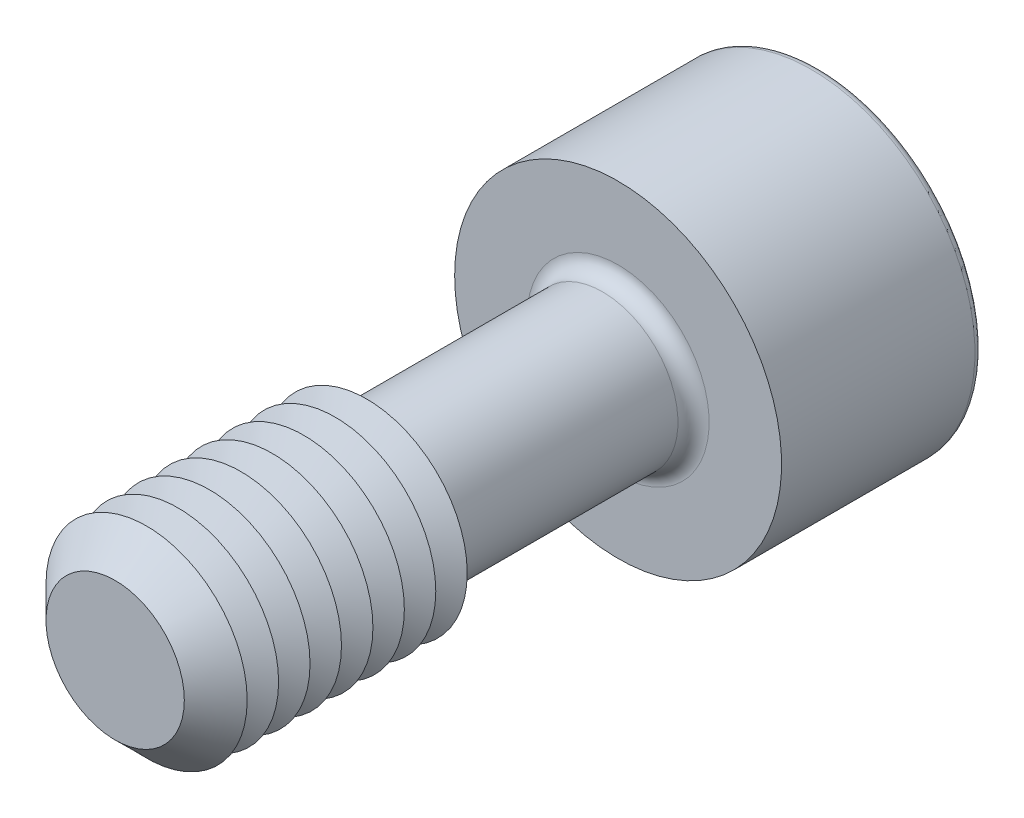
from build123d import *

# Parameters (mm, degrees)
SKETCH1_R       = 3
EXTRUDE1_DEPTH  = 10
CHAMFER1_SIZE   = 1.25
SKETCH3_R       = 6.5
EXTRUDE2_DEPTH  = 8
EXTRUDE3_DEPTH  = 6
FILLET1_R       = 0.62
FILLET2_R       = 0.31
LPATTERN1_COUNT = 7
LPATTERN1_PITCH = 1.25


with BuildPart() as part:
    # Sketch1 → Extrude1 (new, symmetric)
    with BuildSketch(Plane.XY):
        Circle(SKETCH1_R)
    extrude(amount=EXTRUDE1_DEPTH, both=True)

    # Sketch2 → Revolve1 (revolve)
    with BuildSketch(Plane(origin=(0, 0, 0), x_dir=(0, 0, -1), z_dir=(1, 0, 0))):
        Polygon((-10, 0), (-10, 4), (0, 4), (0.577350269, 3), (0.577350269, 0), align=None)
    revolve(axis=Axis((0, 0, -0.577350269), (0, 0, 1)))

    # Chamfer1
    chamfer1_edges = [part.edges().sort_by_distance(p)[0] for p in [
        (0, -4, 10),
    ]]
    chamfer(chamfer1_edges, length=CHAMFER1_SIZE)

    # Sketch3 → Extrude2 (add)
    with BuildSketch(Plane(origin=(0, 0, -10), x_dir=(-1, 0, 0), z_dir=(0, 0, -1))):
        Circle(SKETCH3_R)
    extrude(amount=EXTRUDE2_DEPTH)

    # Sketch4 → Extrude3 (cut)
    with BuildSketch(Plane(origin=(-13.7, 0, -18), x_dir=(1, 0, 0), z_dir=(0, 0, 1))):
        Polygon((11.967949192, -3), (15.432050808, -3), (17.164101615, 0), (15.432050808, 3), (11.967949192, 3), (10.235898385, 0), align=None)
    extrude(amount=EXTRUDE3_DEPTH, mode=Mode.SUBTRACT)

    # Fillet1
    fillet1_edges = [part.edges().sort_by_distance(p)[0] for p in [
        (-3, 0, -10),
    ]]
    fillet(fillet1_edges, radius=FILLET1_R)

    # Fillet2
    fillet2_edges = [part.edges().sort_by_distance(p)[0] for p in [
        (6.5, 0, -18),
    ]]
    fillet(fillet2_edges, radius=FILLET2_R)

    # Sketch5 → Cut-Revolve1 (revolve, cut)
    with BuildSketch(Plane(origin=(0, 0, 0), x_dir=(0, 0, -1), z_dir=(1, 0, 0)), mode=Mode.PRIVATE) as cut_revolve1_sk:
        Polygon((12, 0), (12, -3), (10.267949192, 0), align=None)
    revolve(cut_revolve1_sk.sketch.rotate(Axis((0, 0, -10.267949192), (0, 0, -1)), 90), axis=Axis((0, 0, -10.267949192), (0, 0, -1)), mode=Mode.SUBTRACT)

    # Sketch7 → Cut-Revolve2 (revolve, cut)
    with BuildSketch(Plane(origin=(0, 0, 0), x_dir=(0, 0, -1), z_dir=(1, 0, 0)), mode=Mode.PRIVATE) as cut_revolve2_sk:
        Polygon((0, 4), (-0.625, 2.917468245), (-1.25, 4), align=None)
    cut_revolve2 = revolve(cut_revolve2_sk.sketch.rotate(Axis((0, 0, -1.332048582), (0, 0, 1)), 90), axis=Axis((0, 0, -1.332048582), (0, 0, 1)), mode=Mode.SUBTRACT)

    # LPattern1: Cut-Revolve2 ×7
    with Locations(*[(0, 0, i * LPATTERN1_PITCH) for i in range(1, LPATTERN1_COUNT)]):
        add(cut_revolve2, mode=Mode.SUBTRACT)


solid = part.part
